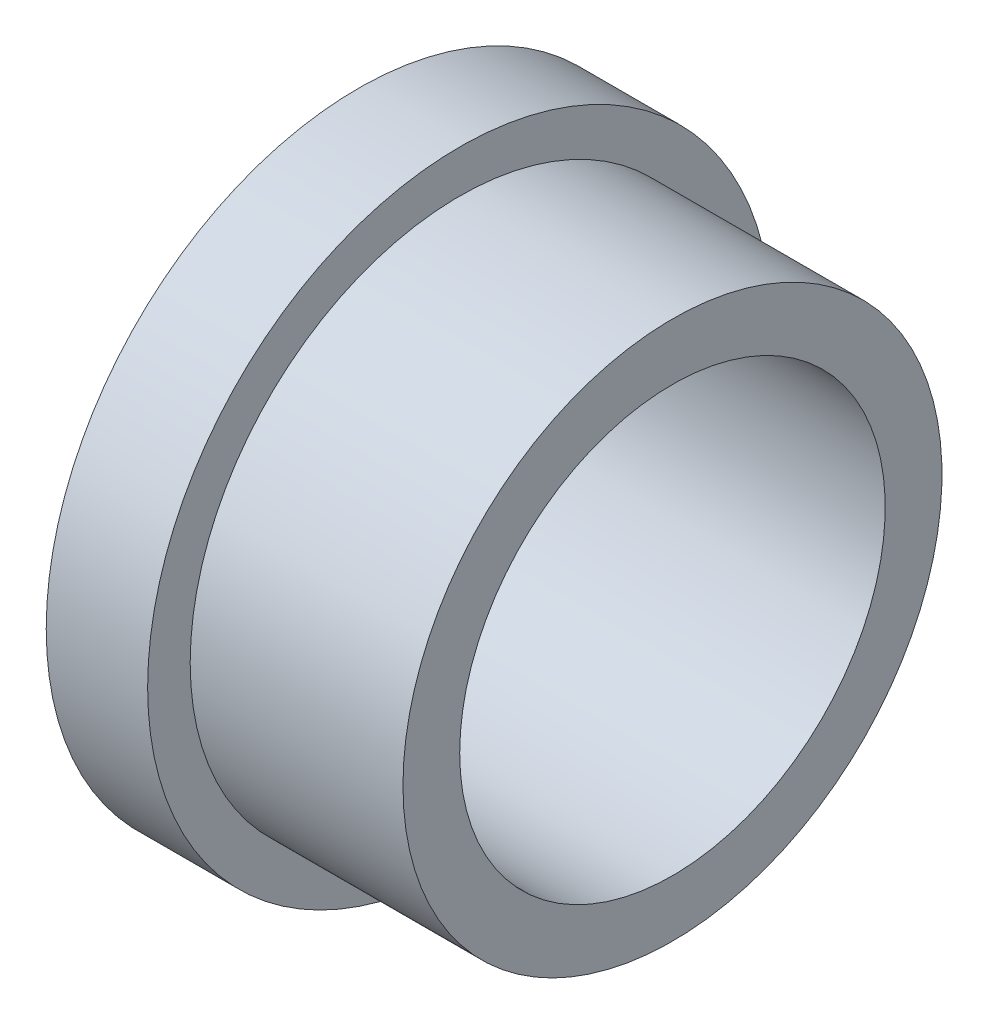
from build123d import *


with BuildPart() as part:
    # Esquisse1 → R_volution1 (revolve)
    with BuildSketch(Plane.XY, mode=Mode.PRIVATE) as r_volution1_sk:
        Polygon((18.499086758, 22), (18.499086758, 15), (40.649086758, 15), (40.649086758, 19), (25.649086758, 19), (25.649086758, 22), align=None)
    revolve(r_volution1_sk.sketch.rotate(Axis((0, 0, 0), (1, 0, 0)), 90), axis=Axis((0, 0, 0), (1, 0, 0)))


solid = part.part
